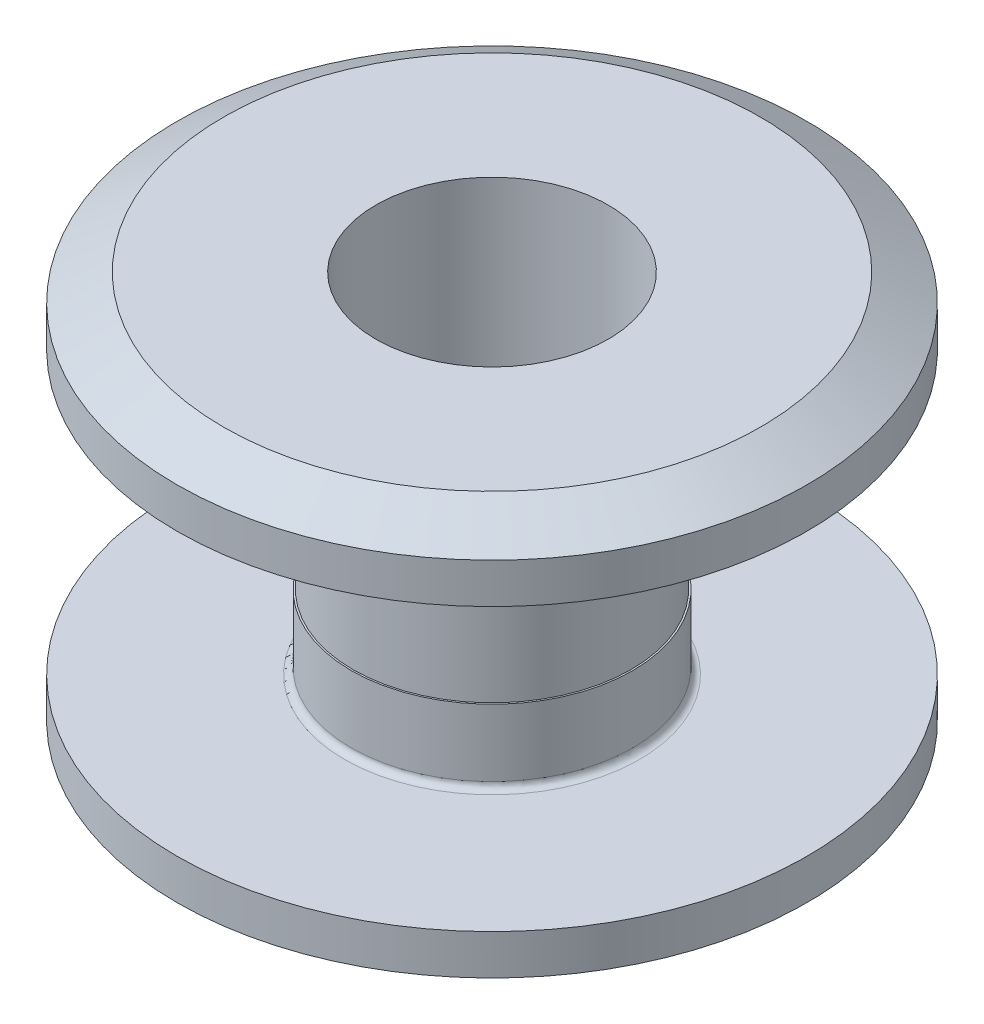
ISO-10303-21;
HEADER;
FILE_DESCRIPTION(('STEP AP214'),'2;1');
FILE_NAME('part.step','',(''),(''),'','','');
FILE_SCHEMA(('AUTOMOTIVE_DESIGN { 1 0 10303 214 1 1 1 1 }'));
ENDSEC;
DATA;
#1=APPLICATION_CONTEXT('core data for automotive mechanical design processes');
#2=APPLICATION_PROTOCOL_DEFINITION('international standard','automotive_design',2000,#1);
#3=PRODUCT_CONTEXT('',#1,'mechanical');
#4=PRODUCT('Part','Part','',(#3));
#5=PRODUCT_RELATED_PRODUCT_CATEGORY('part','',(#4));
#6=PRODUCT_DEFINITION_FORMATION('','',#4);
#7=PRODUCT_DEFINITION_CONTEXT('part definition',#1,'design');
#8=PRODUCT_DEFINITION('design','',#6,#7);
#9=PRODUCT_DEFINITION_SHAPE('','',#8);
#10=(LENGTH_UNIT() NAMED_UNIT(*) SI_UNIT(.MILLI.,.METRE.));
#11=(NAMED_UNIT(*) PLANE_ANGLE_UNIT() SI_UNIT($,.RADIAN.));
#12=(NAMED_UNIT(*) SI_UNIT($,.STERADIAN.) SOLID_ANGLE_UNIT());
#13=UNCERTAINTY_MEASURE_WITH_UNIT(LENGTH_MEASURE(1.E-05),#10,'distance_accuracy_value','');
#14=(GEOMETRIC_REPRESENTATION_CONTEXT(3) GLOBAL_UNCERTAINTY_ASSIGNED_CONTEXT((#13)) GLOBAL_UNIT_ASSIGNED_CONTEXT((#10,
#11,#12)) REPRESENTATION_CONTEXT('',''));
#15=CARTESIAN_POINT('',(0.,0.,0.));
#16=DIRECTION('',(0.,0.,1.));
#17=DIRECTION('',(1.,0.,0.));
#18=AXIS2_PLACEMENT_3D('',#15,#16,#17);
#19=CARTESIAN_POINT('',(-47.,61.9999999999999,0.));
#20=DIRECTION('',(0.,1.,0.));
#21=DIRECTION('',(0.,0.,1.));
#22=AXIS2_PLACEMENT_3D('',#19,#20,#21);
#23=PLANE('',#22);
#24=CARTESIAN_POINT('',(0.,61.9999999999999,0.));
#25=DIRECTION('',(0.,1.,0.));
#26=DIRECTION('',(0.,0.,1.));
#27=AXIS2_PLACEMENT_3D('',#24,#25,#26);
#28=CIRCLE('',#27,40.0717967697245);
#29=CARTESIAN_POINT('',(0.,61.9999999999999,40.0717967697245));
#30=VERTEX_POINT('',#29);
#31=EDGE_CURVE('E52',#30,#30,#28,.T.);
#32=ORIENTED_EDGE('',*,*,#31,.T.);
#33=EDGE_LOOP('',(#32));
#34=FACE_BOUND('',#33,.T.);
#35=CARTESIAN_POINT('',(0.,61.9999999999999,0.));
#36=DIRECTION('',(0.,1.,0.));
#37=DIRECTION('',(0.,0.,1.));
#38=AXIS2_PLACEMENT_3D('',#35,#36,#37);
#39=CIRCLE('',#38,17.35);
#40=CARTESIAN_POINT('',(0.,61.9999999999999,17.35));
#41=VERTEX_POINT('',#40);
#42=EDGE_CURVE('E79',#41,#41,#39,.T.);
#43=ORIENTED_EDGE('',*,*,#42,.F.);
#44=EDGE_LOOP('',(#43));
#45=FACE_BOUND('',#44,.T.);
#46=ADVANCED_FACE('F30',(#34,#45),#23,.T.);
#47=CARTESIAN_POINT('',(0.,0.,0.));
#48=DIRECTION('',(0.,-1.,0.));
#49=DIRECTION('',(0.,0.,-1.));
#50=AXIS2_PLACEMENT_3D('',#47,#48,#49);
#51=PLANE('',#50);
#52=CARTESIAN_POINT('',(0.,0.,0.));
#53=DIRECTION('',(0.,-1.,0.));
#54=DIRECTION('',(0.,0.,-1.));
#55=AXIS2_PLACEMENT_3D('',#52,#53,#54);
#56=CIRCLE('',#55,40.0717967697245);
#57=CARTESIAN_POINT('',(0.,0.,-40.0717967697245));
#58=VERTEX_POINT('',#57);
#59=EDGE_CURVE('E55',#58,#58,#56,.T.);
#60=ORIENTED_EDGE('',*,*,#59,.T.);
#61=EDGE_LOOP('',(#60));
#62=FACE_BOUND('',#61,.T.);
#63=CARTESIAN_POINT('',(0.,0.,0.));
#64=DIRECTION('',(0.,1.,0.));
#65=DIRECTION('',(0.,0.,1.));
#66=AXIS2_PLACEMENT_3D('',#63,#64,#65);
#67=CIRCLE('',#66,17.35);
#68=CARTESIAN_POINT('',(0.,0.,17.35));
#69=VERTEX_POINT('',#68);
#70=EDGE_CURVE('E82',#69,#69,#67,.T.);
#71=ORIENTED_EDGE('',*,*,#70,.T.);
#72=EDGE_LOOP('',(#71));
#73=FACE_BOUND('',#72,.T.);
#74=ADVANCED_FACE('F86',(#62,#73),#51,.T.);
#75=CARTESIAN_POINT('',(0.,99.3334277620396,0.));
#76=DIRECTION('',(0.,1.,0.));
#77=DIRECTION('',(0.,0.,1.));
#78=AXIS2_PLACEMENT_3D('',#75,#76,#77);
#79=CYLINDRICAL_SURFACE('',#78,47.);
#80=CARTESIAN_POINT('',(0.,57.9999999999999,0.));
#81=DIRECTION('',(0.,1.,0.));
#82=DIRECTION('',(0.,0.,1.));
#83=AXIS2_PLACEMENT_3D('',#80,#81,#82);
#84=CIRCLE('',#83,47.);
#85=CARTESIAN_POINT('',(0.,57.9999999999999,47.));
#86=VERTEX_POINT('',#85);
#87=EDGE_CURVE('E49',#86,#86,#84,.F.);
#88=ORIENTED_EDGE('',*,*,#87,.T.);
#89=EDGE_LOOP('',(#88));
#90=FACE_BOUND('',#89,.T.);
#91=CARTESIAN_POINT('',(0.,51.9999999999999,0.));
#92=DIRECTION('',(0.,1.,0.));
#93=DIRECTION('',(0.,0.,1.));
#94=AXIS2_PLACEMENT_3D('',#91,#92,#93);
#95=CIRCLE('',#94,47.);
#96=CARTESIAN_POINT('',(0.,51.9999999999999,47.));
#97=VERTEX_POINT('',#96);
#98=EDGE_CURVE('E61',#97,#97,#95,.T.);
#99=ORIENTED_EDGE('',*,*,#98,.T.);
#100=EDGE_LOOP('',(#99));
#101=FACE_BOUND('',#100,.T.);
#102=ADVANCED_FACE('F104',(#90,#101),#79,.T.);
#103=CARTESIAN_POINT('',(-21.,51.9999999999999,0.));
#104=DIRECTION('',(0.,-1.,0.));
#105=DIRECTION('',(0.,0.,-1.));
#106=AXIS2_PLACEMENT_3D('',#103,#104,#105);
#107=PLANE('',#106);
#108=CARTESIAN_POINT('',(0.,51.9999999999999,0.));
#109=DIRECTION('',(0.,-1.,0.));
#110=DIRECTION('',(0.,0.,-1.));
#111=AXIS2_PLACEMENT_3D('',#108,#109,#110);
#112=CIRCLE('',#111,22.);
#113=CARTESIAN_POINT('',(0.,51.9999999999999,-22.));
#114=VERTEX_POINT('',#113);
#115=EDGE_CURVE('E36',#114,#114,#112,.F.);
#116=ORIENTED_EDGE('',*,*,#115,.T.);
#117=EDGE_LOOP('',(#116));
#118=FACE_BOUND('',#117,.T.);
#119=ORIENTED_EDGE('',*,*,#98,.F.);
#120=EDGE_LOOP('',(#119));
#121=FACE_BOUND('',#120,.T.);
#122=ADVANCED_FACE('F153',(#118,#121),#107,.T.);
#123=CARTESIAN_POINT('',(0.,99.3334277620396,0.));
#124=DIRECTION('',(0.,1.,0.));
#125=DIRECTION('',(0.,0.,1.));
#126=AXIS2_PLACEMENT_3D('',#123,#124,#125);
#127=CYLINDRICAL_SURFACE('',#126,21.);
#128=CARTESIAN_POINT('',(0.,50.9999999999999,0.));
#129=DIRECTION('',(0.,-1.,0.));
#130=DIRECTION('',(0.,0.,-1.));
#131=AXIS2_PLACEMENT_3D('',#128,#129,#130);
#132=CIRCLE('',#131,21.);
#133=CARTESIAN_POINT('',(0.,50.9999999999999,-21.));
#134=VERTEX_POINT('',#133);
#135=EDGE_CURVE('E10',#134,#134,#132,.T.);
#136=ORIENTED_EDGE('',*,*,#135,.T.);
#137=EDGE_LOOP('',(#136));
#138=FACE_BOUND('',#137,.T.);
#139=CARTESIAN_POINT('',(0.,40.9999999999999,0.));
#140=DIRECTION('',(0.,1.,0.));
#141=DIRECTION('',(0.,0.,1.));
#142=AXIS2_PLACEMENT_3D('',#139,#140,#141);
#143=CIRCLE('',#142,21.);
#144=CARTESIAN_POINT('',(0.,40.9999999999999,21.));
#145=VERTEX_POINT('',#144);
#146=EDGE_CURVE('E64',#145,#145,#143,.T.);
#147=ORIENTED_EDGE('',*,*,#146,.T.);
#148=EDGE_LOOP('',(#147));
#149=FACE_BOUND('',#148,.T.);
#150=ADVANCED_FACE('F149',(#138,#149),#127,.T.);
#151=CARTESIAN_POINT('',(-20.75,40.9999999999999,0.));
#152=DIRECTION('',(0.,-1.,0.));
#153=DIRECTION('',(0.,0.,-1.));
#154=AXIS2_PLACEMENT_3D('',#151,#152,#153);
#155=PLANE('',#154);
#156=CARTESIAN_POINT('',(0.,40.9999999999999,0.));
#157=DIRECTION('',(0.,1.,0.));
#158=DIRECTION('',(0.,0.,1.));
#159=AXIS2_PLACEMENT_3D('',#156,#157,#158);
#160=CIRCLE('',#159,20.75);
#161=CARTESIAN_POINT('',(0.,40.9999999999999,20.75));
#162=VERTEX_POINT('',#161);
#163=EDGE_CURVE('E67',#162,#162,#160,.T.);
#164=ORIENTED_EDGE('',*,*,#163,.T.);
#165=EDGE_LOOP('',(#164));
#166=FACE_BOUND('',#165,.T.);
#167=ORIENTED_EDGE('',*,*,#146,.F.);
#168=EDGE_LOOP('',(#167));
#169=FACE_BOUND('',#168,.T.);
#170=ADVANCED_FACE('F145',(#166,#169),#155,.T.);
#171=CARTESIAN_POINT('',(0.,99.3334277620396,0.));
#172=DIRECTION('',(0.,1.,0.));
#173=DIRECTION('',(0.,0.,1.));
#174=AXIS2_PLACEMENT_3D('',#171,#172,#173);
#175=CYLINDRICAL_SURFACE('',#174,20.75);
#176=CARTESIAN_POINT('',(0.,20.9999999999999,0.));
#177=DIRECTION('',(0.,1.,0.));
#178=DIRECTION('',(0.,0.,1.));
#179=AXIS2_PLACEMENT_3D('',#176,#177,#178);
#180=CIRCLE('',#179,20.75);
#181=CARTESIAN_POINT('',(0.,20.9999999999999,20.75));
#182=VERTEX_POINT('',#181);
#183=EDGE_CURVE('E70',#182,#182,#180,.T.);
#184=ORIENTED_EDGE('',*,*,#183,.T.);
#185=EDGE_LOOP('',(#184));
#186=FACE_BOUND('',#185,.T.);
#187=ORIENTED_EDGE('',*,*,#163,.F.);
#188=EDGE_LOOP('',(#187));
#189=FACE_BOUND('',#188,.T.);
#190=ADVANCED_FACE('F141',(#186,#189),#175,.T.);
#191=CARTESIAN_POINT('',(-21.,20.9999999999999,0.));
#192=DIRECTION('',(0.,1.,0.));
#193=DIRECTION('',(0.,0.,1.));
#194=AXIS2_PLACEMENT_3D('',#191,#192,#193);
#195=PLANE('',#194);
#196=CARTESIAN_POINT('',(0.,20.9999999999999,0.));
#197=DIRECTION('',(0.,1.,0.));
#198=DIRECTION('',(0.,0.,1.));
#199=AXIS2_PLACEMENT_3D('',#196,#197,#198);
#200=CIRCLE('',#199,21.);
#201=CARTESIAN_POINT('',(0.,20.9999999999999,21.));
#202=VERTEX_POINT('',#201);
#203=EDGE_CURVE('E73',#202,#202,#200,.T.);
#204=ORIENTED_EDGE('',*,*,#203,.T.);
#205=EDGE_LOOP('',(#204));
#206=FACE_BOUND('',#205,.T.);
#207=ORIENTED_EDGE('',*,*,#183,.F.);
#208=EDGE_LOOP('',(#207));
#209=FACE_BOUND('',#208,.T.);
#210=ADVANCED_FACE('F137',(#206,#209),#195,.T.);
#211=CARTESIAN_POINT('',(0.,99.3334277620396,0.));
#212=DIRECTION('',(0.,1.,0.));
#213=DIRECTION('',(0.,0.,1.));
#214=AXIS2_PLACEMENT_3D('',#211,#212,#213);
#215=CYLINDRICAL_SURFACE('',#214,21.);
#216=CARTESIAN_POINT('',(0.,11.,0.));
#217=DIRECTION('',(0.,1.,0.));
#218=DIRECTION('',(0.,0.,1.));
#219=AXIS2_PLACEMENT_3D('',#216,#217,#218);
#220=CIRCLE('',#219,21.);
#221=CARTESIAN_POINT('',(0.,11.,21.));
#222=VERTEX_POINT('',#221);
#223=EDGE_CURVE('E44',#222,#222,#220,.T.);
#224=ORIENTED_EDGE('',*,*,#223,.T.);
#225=EDGE_LOOP('',(#224));
#226=FACE_BOUND('',#225,.T.);
#227=ORIENTED_EDGE('',*,*,#203,.F.);
#228=EDGE_LOOP('',(#227));
#229=FACE_BOUND('',#228,.T.);
#230=ADVANCED_FACE('F133',(#226,#229),#215,.T.);
#231=CARTESIAN_POINT('',(-47.,9.9999999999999,0.));
#232=DIRECTION('',(0.,1.,0.));
#233=DIRECTION('',(0.,0.,1.));
#234=AXIS2_PLACEMENT_3D('',#231,#232,#233);
#235=PLANE('',#234);
#236=CARTESIAN_POINT('',(0.,9.9999999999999,0.));
#237=DIRECTION('',(0.,1.,0.));
#238=DIRECTION('',(0.,0.,1.));
#239=AXIS2_PLACEMENT_3D('',#236,#237,#238);
#240=CIRCLE('',#239,22.);
#241=CARTESIAN_POINT('',(0.,9.9999999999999,22.));
#242=VERTEX_POINT('',#241);
#243=EDGE_CURVE('E40',#242,#242,#240,.F.);
#244=ORIENTED_EDGE('',*,*,#243,.T.);
#245=EDGE_LOOP('',(#244));
#246=FACE_BOUND('',#245,.T.);
#247=CARTESIAN_POINT('',(0.,9.9999999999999,0.));
#248=DIRECTION('',(0.,1.,0.));
#249=DIRECTION('',(0.,0.,1.));
#250=AXIS2_PLACEMENT_3D('',#247,#248,#249);
#251=CIRCLE('',#250,47.);
#252=CARTESIAN_POINT('',(0.,9.9999999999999,47.));
#253=VERTEX_POINT('',#252);
#254=EDGE_CURVE('E76',#253,#253,#251,.T.);
#255=ORIENTED_EDGE('',*,*,#254,.T.);
#256=EDGE_LOOP('',(#255));
#257=FACE_BOUND('',#256,.T.);
#258=ADVANCED_FACE('F129',(#246,#257),#235,.T.);
#259=CARTESIAN_POINT('',(0.,99.3334277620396,0.));
#260=DIRECTION('',(0.,1.,0.));
#261=DIRECTION('',(0.,0.,1.));
#262=AXIS2_PLACEMENT_3D('',#259,#260,#261);
#263=CYLINDRICAL_SURFACE('',#262,47.);
#264=CARTESIAN_POINT('',(0.,3.99999999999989,0.));
#265=DIRECTION('',(0.,-1.,0.));
#266=DIRECTION('',(0.,0.,-1.));
#267=AXIS2_PLACEMENT_3D('',#264,#265,#266);
#268=CIRCLE('',#267,47.);
#269=CARTESIAN_POINT('',(0.,3.99999999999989,-47.));
#270=VERTEX_POINT('',#269);
#271=EDGE_CURVE('E58',#270,#270,#268,.F.);
#272=ORIENTED_EDGE('',*,*,#271,.T.);
#273=EDGE_LOOP('',(#272));
#274=FACE_BOUND('',#273,.T.);
#275=ORIENTED_EDGE('',*,*,#254,.F.);
#276=EDGE_LOOP('',(#275));
#277=FACE_BOUND('',#276,.T.);
#278=ADVANCED_FACE('F122',(#274,#277),#263,.T.);
#279=CARTESIAN_POINT('',(0.,3.99999999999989,0.));
#280=DIRECTION('',(0.,1.,0.));
#281=DIRECTION('',(0.,0.,1.));
#282=AXIS2_PLACEMENT_3D('',#279,#280,#281);
#283=CONICAL_SURFACE('',#282,47.,1.0471975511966);
#284=ORIENTED_EDGE('',*,*,#59,.F.);
#285=EDGE_LOOP('',(#284));
#286=FACE_BOUND('',#285,.T.);
#287=ORIENTED_EDGE('',*,*,#271,.F.);
#288=EDGE_LOOP('',(#287));
#289=FACE_BOUND('',#288,.T.);
#290=ADVANCED_FACE('F113',(#286,#289),#283,.T.);
#291=CARTESIAN_POINT('',(0.,61.9999999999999,0.));
#292=DIRECTION('',(0.,-1.,0.));
#293=DIRECTION('',(0.,0.,-1.));
#294=AXIS2_PLACEMENT_3D('',#291,#292,#293);
#295=CONICAL_SURFACE('',#294,40.0717967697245,1.0471975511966);
#296=ORIENTED_EDGE('',*,*,#87,.F.);
#297=EDGE_LOOP('',(#296));
#298=FACE_BOUND('',#297,.T.);
#299=ORIENTED_EDGE('',*,*,#31,.F.);
#300=EDGE_LOOP('',(#299));
#301=FACE_BOUND('',#300,.T.);
#302=ADVANCED_FACE('F111',(#298,#301),#295,.T.);
#303=CARTESIAN_POINT('',(0.,11.,0.));
#304=DIRECTION('',(0.,1.,0.));
#305=DIRECTION('',(0.,0.,1.));
#306=AXIS2_PLACEMENT_3D('',#303,#304,#305);
#307=TOROIDAL_SURFACE('',#306,22.,1.);
#308=ORIENTED_EDGE('',*,*,#243,.F.);
#309=EDGE_LOOP('',(#308));
#310=FACE_BOUND('',#309,.T.);
#311=ORIENTED_EDGE('',*,*,#223,.F.);
#312=EDGE_LOOP('',(#311));
#313=FACE_BOUND('',#312,.T.);
#314=ADVANCED_FACE('F96',(#310,#313),#307,.F.);
#315=CARTESIAN_POINT('',(0.,50.9999999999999,0.));
#316=DIRECTION('',(0.,-1.,0.));
#317=DIRECTION('',(0.,0.,-1.));
#318=AXIS2_PLACEMENT_3D('',#315,#316,#317);
#319=TOROIDAL_SURFACE('',#318,22.,1.);
#320=ORIENTED_EDGE('',*,*,#135,.F.);
#321=EDGE_LOOP('',(#320));
#322=FACE_BOUND('',#321,.T.);
#323=ORIENTED_EDGE('',*,*,#115,.F.);
#324=EDGE_LOOP('',(#323));
#325=FACE_BOUND('',#324,.T.);
#326=ADVANCED_FACE('F90',(#322,#325),#319,.F.);
#327=CARTESIAN_POINT('',(0.,61.9999999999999,0.));
#328=DIRECTION('',(0.,-1.,0.));
#329=DIRECTION('',(0.,0.,-1.));
#330=AXIS2_PLACEMENT_3D('',#327,#328,#329);
#331=CYLINDRICAL_SURFACE('',#330,17.35);
#332=ORIENTED_EDGE('',*,*,#42,.T.);
#333=EDGE_LOOP('',(#332));
#334=FACE_BOUND('',#333,.T.);
#335=ORIENTED_EDGE('',*,*,#70,.F.);
#336=EDGE_LOOP('',(#335));
#337=FACE_BOUND('',#336,.T.);
#338=ADVANCED_FACE('F88',(#334,#337),#331,.F.);
#339=CLOSED_SHELL('',(#46,#74,#102,#122,#150,#170,#190,#210,#230,#258,#278,#290,#302,#314,#326,#338));
#340=MANIFOLD_SOLID_BREP('B2',#339);
#341=ADVANCED_BREP_SHAPE_REPRESENTATION('',(#18,#340),#14);
#342=SHAPE_DEFINITION_REPRESENTATION(#9,#341);
ENDSEC;
END-ISO-10303-21;
